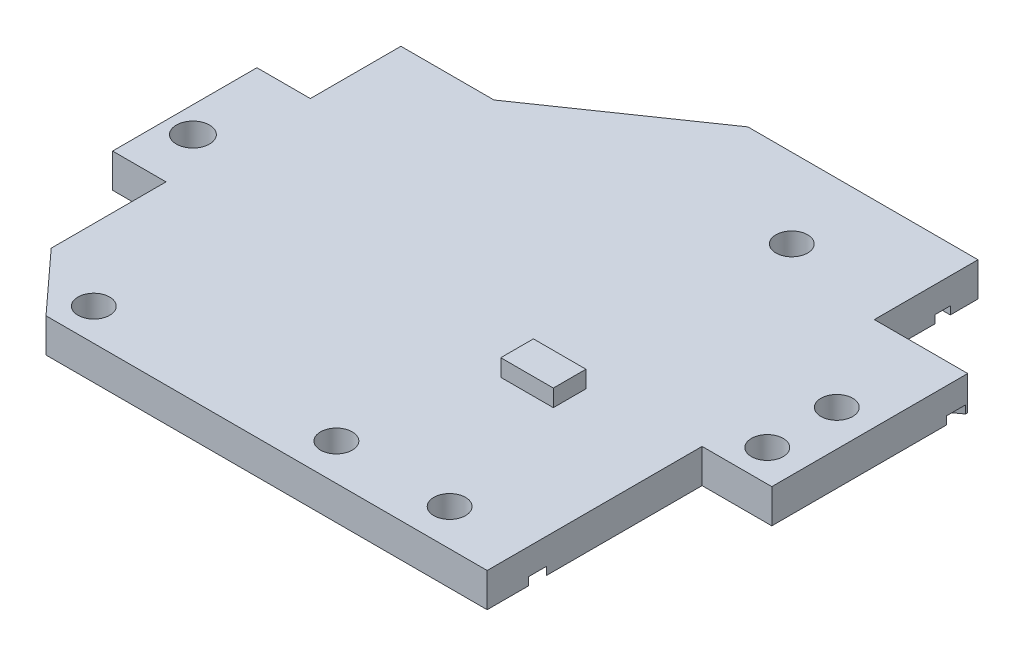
from build123d import *
from build123d.topology import SkipClean

# Parameters (mm, degrees)
SKETCH1_R            = 1.4
BOSS_EXTRUDE1_DEPTH  = 2
SKETCH2_W            = 1.14294107
SKETCH2_H            = 6.244621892
BOSS_EXTRUDE2_DEPTH  = 27
BOSS_EXTRUDE3_DEPTH  = 48
SKETCH4_W            = 28.970733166
SKETCH4_H            = 7.143133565
CUT_EXTRUDE1_DEPTH   = 48
BOSS_EXTRUDE4_DEPTH  = 45
BOSS_EXTRUDE5_DEPTH  = 21
CUT_EXTRUDE2_DEPTH   = 21
SKETCH8_R            = 1.4
BOSS_EXTRUDE6_DEPTH  = 21
CUT_EXTRUDE3_DEPTH   = 21
SKETCH10_W           = 1.838952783
SKETCH10_H           = 6.355218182
CUT_EXTRUDE4_DEPTH   = 21
SKETCH11_R           = 1.4
CUT_EXTRUDE5_DEPTH   = 21
CUT_EXTRUDE6_DEPTH   = 21
SKETCH13_W           = 7.03453315
SKETCH13_H           = 1.837970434
SKETCH13_W_2         = 9.407586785
BOSS_EXTRUDE7_DEPTH  = 20
SKETCH17_W           = 2.228226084
SKETCH17_H           = 28.521229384
BOSS_EXTRUDE9_DEPTH  = 2
BOSS_EXTRUDE10_DEPTH = 5
SKETCH15_R           = 1.4
CUT_EXTRUDE7_DEPTH   = 5
SKETCH19_R           = 1.4
CUT_EXTRUDE8_DEPTH   = 5
BOSS_EXTRUDE15_START = 25
SKETCH21_W           = 21.805975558
SKETCH21_H           = 7.278974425
SKETCH21_R           = 1.4
BOSS_EXTRUDE15_DEPTH = 25
BOSS_EXTRUDE16_DEPTH = 7
SKETCH24_R           = 1.4
CUT_EXTRUDE9_DEPTH   = 13
SKETCH25_R           = 1.4
BOSS_EXTRUDE17_DEPTH = 28
BOSS_EXTRUDE18_START = 3
SKETCH20_W           = 6.138711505
SKETCH20_H           = 11.914337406
SKETCH20_R           = 1.4
SKETCH20_R_2         = 1.461363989
BOSS_EXTRUDE18_DEPTH = 3
SKETCH26_W           = 55.878600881
SKETCH26_H           = 0.284801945
CUT_EXTRUDE10_DEPTH  = 70
SKETCH27_W           = 4.63649767
SKETCH27_H           = 2.878072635
BOSS_EXTRUDE19_DEPTH = 1.5
SKETCH28_R           = 2.827805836
SKETCH28_R_2         = 2.30750548
SKETCH28_R_3         = 2.414128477
SKETCH28_R_4         = 1.788557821
SKETCH28_R_5         = 1.082157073
SKETCH28_R_6         = 0.761054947
SKETCH28_R_7         = 1.496605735
SKETCH28_R_8         = 0.798725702
SKETCH28_W           = 23.283525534
SKETCH28_H           = 3.717808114
CUT_EXTRUDE11_DEPTH  = 0.7
FILLET1_R            = 1
SKETCH29_W           = 44.140332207
SKETCH29_H           = 6.037621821
CUT_EXTRUDE12_DEPTH  = 5


with BuildPart() as part:
    # Sketch1 → Boss-Extrude1 (new body)
    with BuildSketch(Plane(origin=(0, 0, 0), x_dir=(1, 0, 0), z_dir=(0, 1, 0))):
        Polygon((19.077388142, 15.87927265), (19.077388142, -31.970827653), (66.229427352, -31.970827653), (66.229427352, -5.526854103), (70.476418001, -5.526854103), (70.476418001, 6.619955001), (66.229427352, 6.619955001), (66.229427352, 15.87653706), (62.799348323, 15.875096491), (62.799348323, -24.277078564), (42.73606235, -24.277078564), (42.73606235, 15.875096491), (40.466341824, 15.875096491), align=None)
        with Locations(Location((47.728271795, -27.674202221, 0), (0, 0, 270))):
            Circle(SKETCH1_R, mode=Mode.SUBTRACT)
        with Locations(Location((57.728218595, -27.682407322, 0), (0, 0, 270))):
            Circle(SKETCH1_R, mode=Mode.SUBTRACT)
    extrude(amount=BOSS_EXTRUDE1_DEPTH)

    # Sketch2 → Boss-Extrude2 (add)
    with BuildSketch(Plane.XZ):
        Polygon((64.28199318, -6.135219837), (62.981408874, -6.135219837), (62.981408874, 29.739935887), (64.28199318, 29.739935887), (64.28199318, 0.040287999), (70.476418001, 0.040287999), (70.476418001, -6.619955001), (64.28199318, -6.619955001), align=None)
        with Locations((63.773760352, -12.077756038)):
            Rectangle(SKETCH2_W, SKETCH2_H)
    extrude(amount=BOSS_EXTRUDE2_DEPTH)

    # Sketch3 → Boss-Extrude3 (add)
    with BuildSketch(Plane(origin=(0.003101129, 0, -15.882996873), x_dir=(-0.9999999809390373, 0, -0.00019524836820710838), z_dir=(0.00019524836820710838, 0, -0.9999999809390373))):
        Polygon((-42.338281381, 0), (-42.338281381, -5.688969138), (-20.416324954, -5.688969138), (-20.416324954, -3.73812037), (-40.338281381, -3.73812037), (-40.338281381, 2), (-42.338281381, 2), align=None)
    extrude(amount=-BOSS_EXTRUDE3_DEPTH)

    # Sketch4 → Cut-Extrude1 (cut)
    with BuildSketch(Plane(origin=(0.003101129, 0, -15.882996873), x_dir=(-0.9999999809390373, 0, -0.00019524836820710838), z_dir=(0.00019524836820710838, 0, -0.9999999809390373))):
        with Locations((-25.852914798, 1.702506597)):
            Rectangle(SKETCH4_W, SKETCH4_H)
    extrude(amount=-CUT_EXTRUDE1_DEPTH, mode=Mode.SUBTRACT)

    # Sketch5 → Boss-Extrude4 (add)
    with BuildSketch(Plane(origin=(0, 0, -15.200066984), x_dir=(-1, 0, 0), z_dir=(0, 0, -1))):
        Polygon((-66.229427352, 0), (-64.345230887, -6.560311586), (-63.771002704, 0.492410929), (-66.229427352, 0.492410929), align=None)
    extrude(amount=-BOSS_EXTRUDE4_DEPTH)

    # Sketch6 → Boss-Extrude5 (add)
    with BuildSketch(Plane(origin=(0, -5.688969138, 0), x_dir=(-1, 0, 0), z_dir=(0, -1, 0))):
        Polygon((-22.201641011, -4.416810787), (-20.525449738, -4.416810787), (-20.525449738, -23.324903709), (-22.525449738, -23.324903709), (-22.525449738, -24.94084533), (-24.825449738, -24.94084533), (-24.825449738, -17.936978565), (-22.201641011, -17.936978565), align=None)
    extrude(amount=BOSS_EXTRUDE5_DEPTH)

    # Sketch7 → Cut-Extrude2 (cut)
    with BuildSketch(Plane(origin=(0, -5.688969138, 0), x_dir=(-1, 0, 0), z_dir=(0, -1, 0))):
        Polygon((-18.666348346, 5.330887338), (-26.275422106, 5.330887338), (-26.275422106, 11.364144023), (-39.515210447, 11.364144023), (-39.515210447, 16.994858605), (-26.275422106, 16.994858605), (-18.666348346, 16.994858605), align=None)
    extrude(amount=-CUT_EXTRUDE2_DEPTH, mode=Mode.SUBTRACT)

    # Sketch8 → Boss-Extrude6 (add)
    with BuildSketch(Plane(origin=(0, -5.688969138, 0), x_dir=(-1, 0, 0), z_dir=(0, -1, 0))):
        Polygon((-26.727278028, -24.956914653), (-24.51476773, -23.819272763), (-24.51476773, -23.064812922), (-20.525449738, -23.324903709), (-20.648204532, -25.207738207), (-24.409157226, -29.661178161), (-26.678402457, -29.661178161), (-36.642452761, -29.661178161), (-36.642452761, -24.956914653), align=None)
        with Locations(Location((-24.813448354, -26.699794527, 0), (0, 0, 90))):
            Circle(SKETCH8_R, mode=Mode.SUBTRACT)
        with Locations(Location((-33.534342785, -27.214892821, 0), (0, 0, 90))):
            Circle(SKETCH8_R, mode=Mode.SUBTRACT)
    extrude(amount=BOSS_EXTRUDE6_DEPTH)

    # Sketch9 → Cut-Extrude3 (cut)
    with BuildSketch(Plane(origin=(0, -5.688969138, 0), x_dir=(-1, 0, 0), z_dir=(0, -1, 0))):
        Polygon((-26.326983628, -31.980263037), (-18.961915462, -23.929421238), (-17.975597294, -29.600750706), (-17.975597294, -34.501519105), (-40.537625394, -34.501519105), (-40.537625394, -31.980263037), align=None)
    extrude(amount=-CUT_EXTRUDE3_DEPTH, mode=Mode.SUBTRACT)

    # Sketch10 → Cut-Extrude4 (cut)
    with BuildSketch(Plane(origin=(64.345230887, 0, 0), x_dir=(0, 0, -1), z_dir=(1, 0, 0))):
        with Locations((9.874921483, -18.642241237)):
            Rectangle(SKETCH10_W, SKETCH10_H)
    extrude(amount=-CUT_EXTRUDE4_DEPTH, mode=Mode.SUBTRACT)

    # Sketch11 → Cut-Extrude5 (cut)
    with BuildSketch(Plane(origin=(0, 0, -6.619955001), x_dir=(-1, 0, 0), z_dir=(0, 0, -1))):
        with Locations(Location((-65.418326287, -14.793958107, 0), (0, 0, 324.25907452))):
            Circle(SKETCH11_R)
        with Locations(Location((-65.418326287, -24.793958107, 0), (0, 0, 324.25907452))):
            Circle(SKETCH11_R)
    extrude(amount=-CUT_EXTRUDE5_DEPTH, mode=Mode.SUBTRACT)

    # Sketch12 → Cut-Extrude6 (cut)
    with BuildSketch(Plane(origin=(0, -3.73812037, 0), x_dir=(1, 0, 0), z_dir=(0, 1, 0))):
        with BuildLine():
            Line((36.401258, -29.11116348), (36.401258, -27.137102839))
            ThreePointArc((36.401258, -27.137102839), (37.897557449, -25.64080339), (39.393856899, -27.137102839))
            Line((39.393856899, -27.137102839), (39.393856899, -29.11116348))
            ThreePointArc((39.393856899, -29.11116348), (37.897557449, -30.60746293), (36.401258, -29.11116348))
        make_face()
    extrude(amount=-CUT_EXTRUDE6_DEPTH, mode=Mode.SUBTRACT)

    # Sketch13 → Boss-Extrude7 (add)
    with BuildSketch(Plane(origin=(40.338280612, 0, 0.007875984), x_dir=(-0.00019524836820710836, 0, 0.9999999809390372), z_dir=(-0.9999999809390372, 0, -0.00019524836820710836))):
        with Locations((16.125450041, 1.081014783)):
            Rectangle(SKETCH13_W, SKETCH13_H)
        with Locations((0.166372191, 1.081014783)):
            Rectangle(SKETCH13_W_2, SKETCH13_H)
    extrude(amount=BOSS_EXTRUDE7_DEPTH)

    # Sketch17 → Boss-Extrude9 (add)
    with BuildSketch(Plane(origin=(0, -3.73812037, 0), x_dir=(1, 0, 0), z_dir=(0, 1, 0))):
        with Locations((21.855234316, -8.929727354)):
            Rectangle(SKETCH17_W, SKETCH17_H)
    extrude(amount=BOSS_EXTRUDE9_DEPTH)

    # Sketch18 → Boss-Extrude10 (add)
    with BuildSketch(Plane(origin=(0, 2, 0), x_dir=(1, 0, 0), z_dir=(0, 1, 0))):
        Polygon((20.339166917, 4.5334501), (23.025785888, 4.5334501), (23.025785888, -3.245739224), (22.123921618, -3.245739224), (23.025785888, -12.612679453), (23.025785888, -19.647212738), (20.339166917, -19.647212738), align=None)
    extrude(amount=-BOSS_EXTRUDE10_DEPTH)

    # Sketch15 → Cut-Extrude7 (cut)
    with BuildSketch(Plane(origin=(0, -3.73812037, 0), x_dir=(1, 0, 0), z_dir=(0, 1, 0))):
        with Locations(Location((31.563610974, 7.138640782, 0), (0, 0, 180))):
            Circle(SKETCH15_R)
    extrude(amount=-CUT_EXTRUDE7_DEPTH, mode=Mode.SUBTRACT)

    # Sketch19 → Cut-Extrude8 (cut)
    with BuildSketch(Plane(origin=(0, 2, 0), x_dir=(1, 0, 0), z_dir=(0, 1, 0))):
        with Locations(Location((31.881611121, 0, 0), (0, 0, 270))):
            Circle(SKETCH19_R)
    extrude(amount=-CUT_EXTRUDE8_DEPTH, mode=Mode.SUBTRACT)

    # Sketch21 → Boss-Extrude15 (add)
    with SkipClean():  # the faces are left unmerged after this step: merging them gives an invalid solid
        with BuildSketch(Plane.XZ.offset(BOSS_EXTRUDE15_START)):
            with Locations((53.236492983, 28.33134044)):
                Rectangle(SKETCH21_W, SKETCH21_H)
            with Locations(Location((47.728271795, 27.674202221, 0), (0, 0, 270))):
                Circle(SKETCH21_R, mode=Mode.SUBTRACT)
            with Locations(Location((57.728218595, 27.682407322, 0), (0, 0, 270))):
                Circle(SKETCH21_R, mode=Mode.SUBTRACT)
        extrude(amount=-BOSS_EXTRUDE15_DEPTH)

    # Sketch23 → Boss-Extrude16 (add)
    with SkipClean():  # the faces are left unmerged after this step: merging them gives an invalid solid
        with BuildSketch(Plane(origin=(70.476418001, 0, 0), x_dir=(0, 0, -1), z_dir=(1, 0, 0))):
            Polygon((-11.706990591, -21.334664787), (0.708413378, -8.919260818), (1.168243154, -20.8477862), (-0.040287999, -21.334664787), (-0.040287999, -27), (-11.706990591, -27), align=None)
        extrude(amount=-BOSS_EXTRUDE16_DEPTH)

    # Sketch24 → Cut-Extrude9 (cut)
    with SkipClean():  # the faces are left unmerged after this step: merging them gives an invalid solid
        with BuildSketch(Plane.XZ.offset(27)):
            with Locations(Location((67.234177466, 3.031721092, 0), (0, 0, 270))):
                Circle(SKETCH24_R)
            with Locations(Location((67.234177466, 9.164390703, 0), (0, 0, 270))):
                Circle(SKETCH24_R)
        extrude(amount=-CUT_EXTRUDE9_DEPTH, mode=Mode.SUBTRACT)

    # Sketch25 → Boss-Extrude17 (add)
    with SkipClean():  # the faces are left unmerged after this step: merging them gives an invalid solid
        with BuildSketch(Plane.XZ.offset(26.688969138)):
            Polygon((15.703969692, 15.391802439), (20.893339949, 19.735284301), (20.525449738, 15.391802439), (20.525449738, 4.416810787), (15.703969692, 4.416810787), align=None)
            with Locations(Location((18.007368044, 12.321512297, 0), (0, 0, 270))):
                Circle(SKETCH25_R, mode=Mode.SUBTRACT)
            with Locations(Location((18.007368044, 7.330993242, 0), (0, 0, 270))):
                Circle(SKETCH25_R, mode=Mode.SUBTRACT)
        extrude(amount=-BOSS_EXTRUDE17_DEPTH)

    # Sketch20 → Boss-Extrude18 (add)
    # profile 1 of 3: a face of its own
    with SkipClean():  # the faces are left unmerged after this step: merging them gives an invalid solid
        with BuildSketch(Plane(origin=(0, -27, 0), x_dir=(-1, 0, 0), z_dir=(0, -1, 0)).offset(BOSS_EXTRUDE18_START)):
            with Locations((-67.351348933, -5.997456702)):
                Rectangle(SKETCH20_W, SKETCH20_H)
            with Locations(Location((-67.234177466, -9.164390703, 0), (0, 0, 90))):
                Circle(SKETCH20_R, mode=Mode.SUBTRACT)
            with Locations(Location((-67.234177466, -3.031721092, 0), (0, 0, 90))):
                Circle(SKETCH20_R, mode=Mode.SUBTRACT)
        # profile 2 of 3: a face of its own
        with BuildSketch(Plane(origin=(0, -27, 0), x_dir=(-1, 0, 0), z_dir=(0, -1, 0)).offset(BOSS_EXTRUDE18_START)):
            Polygon((-64.272057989, -11.954625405), (-64.272057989, -29.739935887), (-62.981408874, -29.739935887), (-62.981408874, 5.330887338), (-64.272057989, 5.330887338), (-70.420704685, 5.330887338), (-70.420704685, -0.040287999), (-64.28199318, -0.040287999), (-64.28199318, -11.954625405), align=None)
        # profile 3 of 3: a face of its own
        with BuildSketch(Plane(origin=(0, -27, 0), x_dir=(-1, 0, 0), z_dir=(0, -1, 0)).offset(BOSS_EXTRUDE18_START)):
            Polygon((-64.272057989, -29.739935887), (-64.272057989, -31.970827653), (-26.318351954, -31.970827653), (-20.41736619, -25.520391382), (-20.41736619, -15.391802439), (-15.703969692, -15.391802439), (-15.703969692, -2.659123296), (-20.41736619, -2.659123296), (-20.41736619, 5.330887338), (-28.625370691, 5.330887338), (-41.883466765, 14.476229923), (-62.18125987, 14.476229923), (-62.18125987, 5.330887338), (-62.981408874, 5.330887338), (-62.981408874, -29.739935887), align=None)
            with Locations(Location((-57.728218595, -27.682407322, 0), (0, 0, 90))):
                Circle(SKETCH20_R, mode=Mode.SUBTRACT)
            with Locations(Location((-47.728271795, -27.674202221, 0), (0, 0, 90))):
                Circle(SKETCH20_R, mode=Mode.SUBTRACT)
            with Locations(Location((-26.727278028, -28.071942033, 0), (0, 0, 90))):
                Circle(SKETCH20_R, mode=Mode.SUBTRACT)
            with Locations(Location((-17.989551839, -10.589719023, 0), (0, 0, 90))):
                Circle(SKETCH20_R_2, mode=Mode.SUBTRACT)
            with Locations(Location((-52.756919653, 7.472419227, 0), (0, 0, 90))):
                Circle(SKETCH20_R, mode=Mode.SUBTRACT)
        extrude(amount=-BOSS_EXTRUDE18_DEPTH)

    # Sketch26 → Cut-Extrude10 (cut)
    with SkipClean():  # the faces are left unmerged after this step: merging them gives an invalid solid
        with BuildSketch(Plane(origin=(0, 0, -6.619955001), x_dir=(-1, 0, 0), z_dir=(0, 0, -1))):
            with Locations((-43.643270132, -26.857599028)):
                Rectangle(SKETCH26_W, SKETCH26_H)
        extrude(amount=-CUT_EXTRUDE10_DEPTH, mode=Mode.SUBTRACT)


with BuildPart() as cut_extrude10_piece_1:
    # of the separate pieces the step leaves, piece 1, a body of its own (cut_extrude10_pieces)
    add(part.part.solids().sort_by_distance((40.341381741, 2, -15.875120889))[0])


with BuildPart() as cut_extrude10_piece_2:
    # of the separate pieces the step leaves, piece 2, a body of its own (cut_extrude10_pieces)
    add(part.part.solids().sort_by_distance((62.981408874, -27, -5.330887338))[0])

    # Sketch27 → Boss-Extrude19 (add)
    with BuildSketch(Plane(origin=(0, -27, 0), x_dir=(1, 0, 0), z_dir=(0, 1, 0))):
        with Locations((52.433946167, -14.120157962)):
            Rectangle(SKETCH27_W, SKETCH27_H)
    extrude(amount=BOSS_EXTRUDE19_DEPTH)

    # Sketch28 → Cut-Extrude11 (cut)
    # profile 1 of 7: a face of its own
    with BuildSketch(Plane(origin=(0, -30, 0), x_dir=(-1, 0, 0), z_dir=(0, -1, 0))):
        with Locations(Location((-25.34180697, -14.969711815, 0), (0, 0, 90))):
            Circle(SKETCH28_R)
        with Locations(Location((-25.34180697, -14.969711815, 0), (0, 0, 90))):
            Circle(SKETCH28_R_2, mode=Mode.SUBTRACT)
    # profile 2 of 7: a face of its own
    with BuildSketch(Plane(origin=(0, -30, 0), x_dir=(-1, 0, 0), z_dir=(0, -1, 0))):
        with Locations(Location((-58.385325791, -20.301755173, 0), (0, 0, 90))):
            Circle(SKETCH28_R_3)
        with Locations(Location((-58.385325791, -20.301755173, 0), (0, 0, 90))):
            Circle(SKETCH28_R_4, mode=Mode.SUBTRACT)
    # profile 3 of 7: a face of its own
    with BuildSketch(Plane(origin=(0, -30, 0), x_dir=(-1, 0, 0), z_dir=(0, -1, 0))):
        with Locations(Location((-62.24915873, 1.431734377, 0), (0, 0, 90))):
            Circle(SKETCH28_R_5)
        with Locations(Location((-62.24915873, 1.431734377, 0), (0, 0, 90))):
            Circle(SKETCH28_R_6, mode=Mode.SUBTRACT)
    # profile 4 of 7: a face of its own
    with BuildSketch(Plane(origin=(0, -30, 0), x_dir=(-1, 0, 0), z_dir=(0, -1, 0))):
        with Locations(Location((-24.991250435, 0.67067943, 0), (0, 0, 90))):
            Circle(SKETCH28_R_7)
        with Locations(Location((-24.991250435, 0.67067943, 0), (0, 0, 90))):
            Circle(SKETCH28_R_8, mode=Mode.SUBTRACT)
    # profile 5 of 7: a face of its own
    with BuildSketch(Plane(origin=(0, -30, 0), x_dir=(-1, 0, 0), z_dir=(0, -1, 0))):
        Polygon((-25.34180697, -21.153162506), (-31.942966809, -27.754322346), (-31.942966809, -30.158212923), (-44.191361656, -30.158212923), (-44.191361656, -24.453742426), (-61.438322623, -24.453742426), (-66.312878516, -29.328298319), (-67.123714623, -28.517462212), (-62.24915873, -23.642906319), (-44.191361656, -23.642906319), (-43.046651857, -23.642906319), (-43.046651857, -28.956267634), (-32.591635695, -28.956267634), (-32.591635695, -27.305977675), (-23.066696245, -17.781038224), (-21.110844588, -17.781038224), (-21.110844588, -29.328298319), (-21.686693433, -29.328298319), (-21.686693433, -18.61685494), (-23.066696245, -18.61685494), align=None)
    # profile 6 of 7: a face of its own
    with BuildSketch(Plane(origin=(0, -30, 0), x_dir=(-1, 0, 0), z_dir=(0, -1, 0))):
        Polygon((-28.169612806, -11.882144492), (-33.5854503, -17.297981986), (-37.419133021, -17.297981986), (-37.419133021, -20.024699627), (-53.423237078, -20.024699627), (-53.423237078, -17.297981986), (-55.674765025, -17.297981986), (-61.334010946, -12.429813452), (-61.334010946, -3.06465347), (-72.000844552, 4.612895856), (-71.198287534, 5.709327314), (-60.569325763, -2.070774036), (-55.674765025, 3.209177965), (-32.591635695, 3.209177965), (-28.169612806, -3.180293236), align=None)
        Polygon((-29.906092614, -12.077418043), (-34.354713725, -16.526039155), (-38.095202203, -16.526039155), (-38.095202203, -18.972116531), (-52.758696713, -18.972116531), (-52.758696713, -16.526039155), (-55.39490942, -16.526039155), (-60.01534046, -12.52684254), (-60.01534046, -2.564481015), (-55.200365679, 2.607166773), (-33.262006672, 2.607166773), (-29.906092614, -2.070774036), align=None, mode=Mode.SUBTRACT)
    # profile 7 of 7: a face of its own
    with BuildSketch(Plane(origin=(0, -30, 0), x_dir=(-1, 0, 0), z_dir=(0, -1, 0))):
        Polygon((-41.946464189, 12.754531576), (-30.226046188, 5.261008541), (-28.169612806, 7.793492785), (-27.730620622, 7.437021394), (-31.008859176, 3.399892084), (-42.398530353, 10.681950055), (-67.123714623, 10.681950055), (-67.123714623, 16.476841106), (-41.946464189, 16.476841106), align=None)
        with Locations((-54.455571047, 13.889975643)):
            Rectangle(SKETCH28_W, SKETCH28_H, mode=Mode.SUBTRACT)
    extrude(amount=-CUT_EXTRUDE11_DEPTH, mode=Mode.SUBTRACT)

    # Fillet1
    fillet1_edges = [cut_extrude10_piece_2.edges().sort_by_distance(p)[0] for p in [
        (61.334010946, -29.65, 3.06465347),
        (37.419133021, -29.65, 17.297981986),
        (37.419133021, -29.65, 20.024699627),
        (53.423237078, -29.65, 20.024699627),
        (55.674765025, -29.65, 17.297981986),
        (61.334010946, -29.65, 12.429813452),
        (60.569325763, -29.65, 2.070774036),
        (33.5854503, -29.65, 17.297981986),
        (52.758696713, -29.65, 18.972116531),
        (55.39490942, -29.65, 16.526039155),
        (60.01534046, -29.65, 12.52684254),
        (60.01534046, -29.65, 2.564481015),
        (38.095202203, -29.65, 16.526039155),
        (31.942966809, -29.65, 27.754322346),
        (31.942966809, -29.65, 30.158212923),
        (44.191361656, -29.65, 30.158212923),
        (44.191361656, -29.65, 24.453742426),
        (43.046651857, -29.65, 23.642906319),
        (43.046651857, -29.65, 28.956267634),
        (32.591635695, -29.65, 28.956267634),
        (32.591635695, -29.65, 27.305977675),
    ]]
    fillet(fillet1_edges, radius=FILLET1_R)

    # Sketch29 → Cut-Extrude12 (cut)
    with BuildSketch(Plane(origin=(0, -27, 0), x_dir=(1, 0, 0), z_dir=(0, 1, 0))):
        with Locations((43.609265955, -33.934953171)):
            Rectangle(SKETCH29_W, SKETCH29_H)
    extrude(amount=-CUT_EXTRUDE12_DEPTH, mode=Mode.SUBTRACT)


solid = cut_extrude10_piece_2.part
